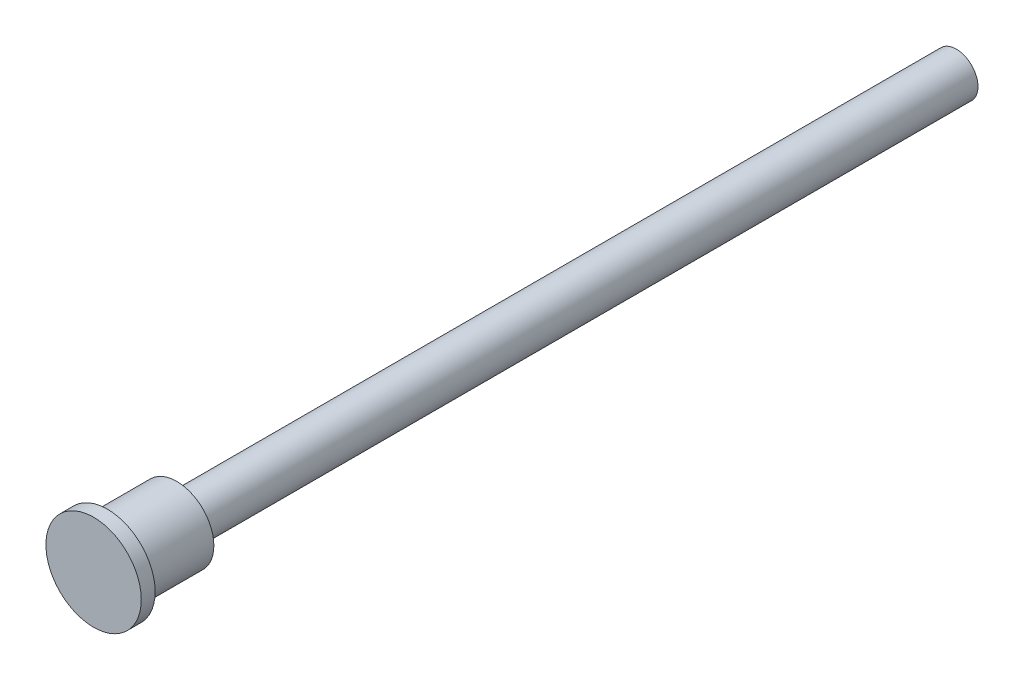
ISO-10303-21;
HEADER;
FILE_DESCRIPTION(('STEP AP214'),'2;1');
FILE_NAME('part.step','',(''),(''),'','','');
FILE_SCHEMA(('AUTOMOTIVE_DESIGN { 1 0 10303 214 1 1 1 1 }'));
ENDSEC;
DATA;
#1=APPLICATION_CONTEXT('core data for automotive mechanical design processes');
#2=APPLICATION_PROTOCOL_DEFINITION('international standard','automotive_design',2000,#1);
#3=PRODUCT_CONTEXT('',#1,'mechanical');
#4=PRODUCT('Part','Part','',(#3));
#5=PRODUCT_RELATED_PRODUCT_CATEGORY('part','',(#4));
#6=PRODUCT_DEFINITION_FORMATION('','',#4);
#7=PRODUCT_DEFINITION_CONTEXT('part definition',#1,'design');
#8=PRODUCT_DEFINITION('design','',#6,#7);
#9=PRODUCT_DEFINITION_SHAPE('','',#8);
#10=(LENGTH_UNIT() NAMED_UNIT(*) SI_UNIT(.MILLI.,.METRE.));
#11=(NAMED_UNIT(*) PLANE_ANGLE_UNIT() SI_UNIT($,.RADIAN.));
#12=(NAMED_UNIT(*) SI_UNIT($,.STERADIAN.) SOLID_ANGLE_UNIT());
#13=UNCERTAINTY_MEASURE_WITH_UNIT(LENGTH_MEASURE(1.E-05),#10,'distance_accuracy_value','');
#14=(GEOMETRIC_REPRESENTATION_CONTEXT(3) GLOBAL_UNCERTAINTY_ASSIGNED_CONTEXT((#13)) GLOBAL_UNIT_ASSIGNED_CONTEXT((#10,
#11,#12)) REPRESENTATION_CONTEXT('',''));
#15=CARTESIAN_POINT('',(0.,0.,0.));
#16=DIRECTION('',(0.,0.,1.));
#17=DIRECTION('',(1.,0.,0.));
#18=AXIS2_PLACEMENT_3D('',#15,#16,#17);
#19=CARTESIAN_POINT('',(0.,0.,44.99991));
#20=DIRECTION('',(0.,0.,-1.));
#21=DIRECTION('',(-1.,0.,0.));
#22=AXIS2_PLACEMENT_3D('',#19,#20,#21);
#23=CYLINDRICAL_SURFACE('',#22,1.25);
#24=CARTESIAN_POINT('',(0.,0.,44.99991));
#25=DIRECTION('',(0.,0.,1.));
#26=DIRECTION('',(1.,0.,0.));
#27=AXIS2_PLACEMENT_3D('',#24,#25,#26);
#28=CIRCLE('',#27,1.25);
#29=CARTESIAN_POINT('',(1.25,0.,44.99991));
#30=VERTEX_POINT('',#29);
#31=EDGE_CURVE('E10',#30,#30,#28,.T.);
#32=ORIENTED_EDGE('',*,*,#31,.F.);
#33=EDGE_LOOP('',(#32));
#34=FACE_BOUND('',#33,.T.);
#35=CARTESIAN_POINT('',(0.,0.,0.));
#36=DIRECTION('',(0.,0.,1.));
#37=DIRECTION('',(1.,0.,0.));
#38=AXIS2_PLACEMENT_3D('',#35,#36,#37);
#39=CIRCLE('',#38,1.25);
#40=CARTESIAN_POINT('',(1.25,0.,0.));
#41=VERTEX_POINT('',#40);
#42=EDGE_CURVE('E42',#41,#41,#39,.T.);
#43=ORIENTED_EDGE('',*,*,#42,.T.);
#44=EDGE_LOOP('',(#43));
#45=FACE_BOUND('',#44,.T.);
#46=ADVANCED_FACE('F39',(#34,#45),#23,.T.);
#47=CARTESIAN_POINT('',(0.,0.,0.));
#48=DIRECTION('',(0.,0.,1.));
#49=DIRECTION('',(1.,0.,0.));
#50=AXIS2_PLACEMENT_3D('',#47,#48,#49);
#51=PLANE('',#50);
#52=ORIENTED_EDGE('',*,*,#42,.F.);
#53=EDGE_LOOP('',(#52));
#54=FACE_BOUND('',#53,.T.);
#55=ADVANCED_FACE('F81',(#54),#51,.F.);
#56=CARTESIAN_POINT('',(0.,0.,48.99991));
#57=DIRECTION('',(0.,0.,-1.));
#58=DIRECTION('',(-1.,0.,0.));
#59=AXIS2_PLACEMENT_3D('',#56,#57,#58);
#60=CYLINDRICAL_SURFACE('',#59,2.14183765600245);
#61=CARTESIAN_POINT('',(0.,0.,48.99991));
#62=DIRECTION('',(0.,0.,1.));
#63=DIRECTION('',(1.,0.,0.));
#64=AXIS2_PLACEMENT_3D('',#61,#62,#63);
#65=CIRCLE('',#64,2.14183765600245);
#66=CARTESIAN_POINT('',(2.14183765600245,0.,48.99991));
#67=VERTEX_POINT('',#66);
#68=EDGE_CURVE('E49',#67,#67,#65,.T.);
#69=ORIENTED_EDGE('',*,*,#68,.F.);
#70=EDGE_LOOP('',(#69));
#71=FACE_BOUND('',#70,.T.);
#72=CARTESIAN_POINT('',(0.,0.,44.99991));
#73=DIRECTION('',(0.,0.,1.));
#74=DIRECTION('',(1.,0.,0.));
#75=AXIS2_PLACEMENT_3D('',#72,#73,#74);
#76=CIRCLE('',#75,2.14183765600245);
#77=CARTESIAN_POINT('',(2.14183765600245,0.,44.99991));
#78=VERTEX_POINT('',#77);
#79=EDGE_CURVE('E51',#78,#78,#76,.T.);
#80=ORIENTED_EDGE('',*,*,#79,.T.);
#81=EDGE_LOOP('',(#80));
#82=FACE_BOUND('',#81,.T.);
#83=ADVANCED_FACE('F86',(#71,#82),#60,.T.);
#84=CARTESIAN_POINT('',(0.,0.,44.99991));
#85=DIRECTION('',(0.,0.,1.));
#86=DIRECTION('',(1.,0.,0.));
#87=AXIS2_PLACEMENT_3D('',#84,#85,#86);
#88=PLANE('',#87);
#89=ORIENTED_EDGE('',*,*,#31,.T.);
#90=EDGE_LOOP('',(#89));
#91=FACE_BOUND('',#90,.T.);
#92=ORIENTED_EDGE('',*,*,#79,.F.);
#93=EDGE_LOOP('',(#92));
#94=FACE_BOUND('',#93,.T.);
#95=ADVANCED_FACE('F68',(#91,#94),#88,.F.);
#96=CARTESIAN_POINT('',(0.,0.,49.79991));
#97=DIRECTION('',(0.,0.,-1.));
#98=DIRECTION('',(-1.,0.,0.));
#99=AXIS2_PLACEMENT_3D('',#96,#97,#98);
#100=CYLINDRICAL_SURFACE('',#99,2.75237297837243);
#101=CARTESIAN_POINT('',(0.,0.,49.79991));
#102=DIRECTION('',(0.,0.,1.));
#103=DIRECTION('',(1.,0.,0.));
#104=AXIS2_PLACEMENT_3D('',#101,#102,#103);
#105=CIRCLE('',#104,2.75237297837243);
#106=CARTESIAN_POINT('',(2.75237297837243,0.,49.79991));
#107=VERTEX_POINT('',#106);
#108=EDGE_CURVE('E54',#107,#107,#105,.T.);
#109=ORIENTED_EDGE('',*,*,#108,.F.);
#110=EDGE_LOOP('',(#109));
#111=FACE_BOUND('',#110,.T.);
#112=CARTESIAN_POINT('',(0.,0.,48.99991));
#113=DIRECTION('',(0.,0.,1.));
#114=DIRECTION('',(1.,0.,0.));
#115=AXIS2_PLACEMENT_3D('',#112,#113,#114);
#116=CIRCLE('',#115,2.75237297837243);
#117=CARTESIAN_POINT('',(2.75237297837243,0.,48.99991));
#118=VERTEX_POINT('',#117);
#119=EDGE_CURVE('E57',#118,#118,#116,.T.);
#120=ORIENTED_EDGE('',*,*,#119,.T.);
#121=EDGE_LOOP('',(#120));
#122=FACE_BOUND('',#121,.T.);
#123=ADVANCED_FACE('F65',(#111,#122),#100,.T.);
#124=CARTESIAN_POINT('',(0.,0.,49.79991));
#125=DIRECTION('',(0.,0.,1.));
#126=DIRECTION('',(1.,0.,0.));
#127=AXIS2_PLACEMENT_3D('',#124,#125,#126);
#128=PLANE('',#127);
#129=ORIENTED_EDGE('',*,*,#108,.T.);
#130=EDGE_LOOP('',(#129));
#131=FACE_BOUND('',#130,.T.);
#132=ADVANCED_FACE('F63',(#131),#128,.T.);
#133=CARTESIAN_POINT('',(0.,0.,48.99991));
#134=DIRECTION('',(0.,0.,1.));
#135=DIRECTION('',(1.,0.,0.));
#136=AXIS2_PLACEMENT_3D('',#133,#134,#135);
#137=PLANE('',#136);
#138=ORIENTED_EDGE('',*,*,#68,.T.);
#139=EDGE_LOOP('',(#138));
#140=FACE_BOUND('',#139,.T.);
#141=ORIENTED_EDGE('',*,*,#119,.F.);
#142=EDGE_LOOP('',(#141));
#143=FACE_BOUND('',#142,.T.);
#144=ADVANCED_FACE('F72',(#140,#143),#137,.F.);
#145=CLOSED_SHELL('',(#46,#55,#83,#95,#123,#132,#144));
#146=MANIFOLD_SOLID_BREP('B2',#145);
#147=ADVANCED_BREP_SHAPE_REPRESENTATION('',(#18,#146),#14);
#148=SHAPE_DEFINITION_REPRESENTATION(#9,#147);
ENDSEC;
END-ISO-10303-21;
